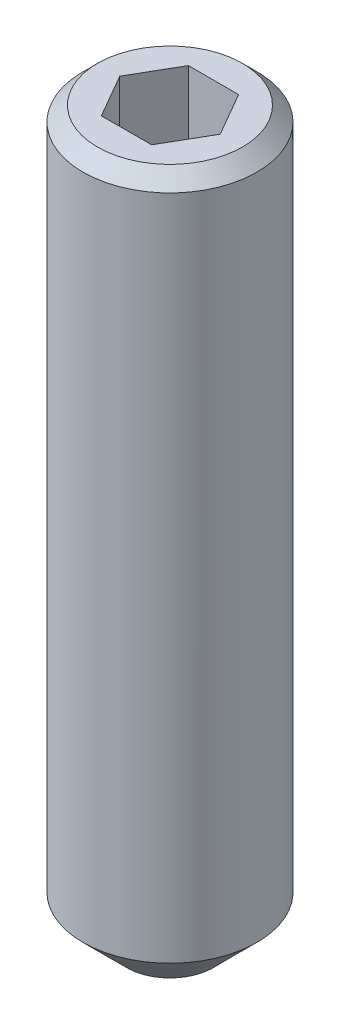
ISO-10303-21;
HEADER;
FILE_DESCRIPTION(('STEP AP214'),'2;1');
FILE_NAME('part.step','',(''),(''),'','','');
FILE_SCHEMA(('AUTOMOTIVE_DESIGN { 1 0 10303 214 1 1 1 1 }'));
ENDSEC;
DATA;
#1=APPLICATION_CONTEXT('core data for automotive mechanical design processes');
#2=APPLICATION_PROTOCOL_DEFINITION('international standard','automotive_design',2000,#1);
#3=PRODUCT_CONTEXT('',#1,'mechanical');
#4=PRODUCT('Part','Part','',(#3));
#5=PRODUCT_RELATED_PRODUCT_CATEGORY('part','',(#4));
#6=PRODUCT_DEFINITION_FORMATION('','',#4);
#7=PRODUCT_DEFINITION_CONTEXT('part definition',#1,'design');
#8=PRODUCT_DEFINITION('design','',#6,#7);
#9=PRODUCT_DEFINITION_SHAPE('','',#8);
#10=(LENGTH_UNIT() NAMED_UNIT(*) SI_UNIT(.MILLI.,.METRE.));
#11=(NAMED_UNIT(*) PLANE_ANGLE_UNIT() SI_UNIT($,.RADIAN.));
#12=(NAMED_UNIT(*) SI_UNIT($,.STERADIAN.) SOLID_ANGLE_UNIT());
#13=UNCERTAINTY_MEASURE_WITH_UNIT(LENGTH_MEASURE(1.E-05),#10,'distance_accuracy_value','');
#14=(GEOMETRIC_REPRESENTATION_CONTEXT(3) GLOBAL_UNCERTAINTY_ASSIGNED_CONTEXT((#13)) GLOBAL_UNIT_ASSIGNED_CONTEXT((#10,
#11,#12)) REPRESENTATION_CONTEXT('',''));
#15=CARTESIAN_POINT('',(0.,0.,0.));
#16=DIRECTION('',(0.,0.,1.));
#17=DIRECTION('',(1.,0.,0.));
#18=AXIS2_PLACEMENT_3D('',#15,#16,#17);
#19=CARTESIAN_POINT('',(0.,25.,0.));
#20=DIRECTION('',(0.,-1.,0.));
#21=DIRECTION('',(0.,0.,-1.));
#22=AXIS2_PLACEMENT_3D('',#19,#20,#21);
#23=CYLINDRICAL_SURFACE('',#22,3.);
#24=CARTESIAN_POINT('',(0.,24.5,0.));
#25=DIRECTION('',(0.,1.,0.));
#26=DIRECTION('',(0.,0.,1.));
#27=AXIS2_PLACEMENT_3D('',#24,#25,#26);
#28=CIRCLE('',#27,3.);
#29=CARTESIAN_POINT('',(0.,24.5,3.));
#30=VERTEX_POINT('',#29);
#31=EDGE_CURVE('E12',#30,#30,#28,.F.);
#32=ORIENTED_EDGE('',*,*,#31,.T.);
#33=EDGE_LOOP('',(#32));
#34=FACE_BOUND('',#33,.T.);
#35=CARTESIAN_POINT('',(0.,1.5,0.));
#36=DIRECTION('',(0.,1.,0.));
#37=DIRECTION('',(0.,0.,1.));
#38=AXIS2_PLACEMENT_3D('',#35,#36,#37);
#39=CIRCLE('',#38,3.);
#40=CARTESIAN_POINT('',(0.,1.5,3.));
#41=VERTEX_POINT('',#40);
#42=EDGE_CURVE('E127',#41,#41,#39,.F.);
#43=ORIENTED_EDGE('',*,*,#42,.F.);
#44=EDGE_LOOP('',(#43));
#45=FACE_BOUND('',#44,.T.);
#46=ADVANCED_FACE('F38',(#34,#45),#23,.T.);
#47=CARTESIAN_POINT('',(0.,25.,0.));
#48=DIRECTION('',(0.,1.,0.));
#49=DIRECTION('',(0.,0.,1.));
#50=AXIS2_PLACEMENT_3D('',#47,#48,#49);
#51=PLANE('',#50);
#52=CARTESIAN_POINT('',(0.,25.,0.));
#53=DIRECTION('',(0.,1.,0.));
#54=DIRECTION('',(0.,0.,1.));
#55=AXIS2_PLACEMENT_3D('',#52,#53,#54);
#56=CIRCLE('',#55,2.5);
#57=CARTESIAN_POINT('',(0.,25.,2.5));
#58=VERTEX_POINT('',#57);
#59=EDGE_CURVE('E46',#58,#58,#56,.T.);
#60=ORIENTED_EDGE('',*,*,#59,.T.);
#61=EDGE_LOOP('',(#60));
#62=FACE_BOUND('',#61,.T.);
#63=DIRECTION('',(-1.,0.,0.));
#64=VECTOR('',#63,1.);
#65=CARTESIAN_POINT('',(0.866025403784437,25.,1.5));
#66=LINE('',#65,#64);
#67=CARTESIAN_POINT('',(0.866025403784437,25.,1.5));
#68=VERTEX_POINT('',#67);
#69=CARTESIAN_POINT('',(-0.866025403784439,25.,1.5));
#70=VERTEX_POINT('',#69);
#71=EDGE_CURVE('E136',#68,#70,#66,.T.);
#72=ORIENTED_EDGE('',*,*,#71,.T.);
#73=DIRECTION('',(-0.5,0.,-0.866025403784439));
#74=VECTOR('',#73,1.);
#75=CARTESIAN_POINT('',(-0.866025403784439,25.,1.5));
#76=LINE('',#75,#74);
#77=CARTESIAN_POINT('',(-1.73205080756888,25.,0.));
#78=VERTEX_POINT('',#77);
#79=EDGE_CURVE('E53',#70,#78,#76,.T.);
#80=ORIENTED_EDGE('',*,*,#79,.T.);
#81=DIRECTION('',(0.5,0.,-0.866025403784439));
#82=VECTOR('',#81,1.);
#83=CARTESIAN_POINT('',(-1.73205080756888,25.,0.));
#84=LINE('',#83,#82);
#85=CARTESIAN_POINT('',(-0.866025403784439,25.,-1.5));
#86=VERTEX_POINT('',#85);
#87=EDGE_CURVE('E126',#78,#86,#84,.T.);
#88=ORIENTED_EDGE('',*,*,#87,.T.);
#89=DIRECTION('',(1.,0.,0.));
#90=VECTOR('',#89,1.);
#91=CARTESIAN_POINT('',(-0.866025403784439,25.,-1.5));
#92=LINE('',#91,#90);
#93=CARTESIAN_POINT('',(0.866025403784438,25.,-1.5));
#94=VERTEX_POINT('',#93);
#95=EDGE_CURVE('E130',#86,#94,#92,.T.);
#96=ORIENTED_EDGE('',*,*,#95,.T.);
#97=DIRECTION('',(0.5,0.,0.866025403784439));
#98=VECTOR('',#97,1.);
#99=CARTESIAN_POINT('',(0.866025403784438,25.,-1.5));
#100=LINE('',#99,#98);
#101=CARTESIAN_POINT('',(1.73205080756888,25.,0.));
#102=VERTEX_POINT('',#101);
#103=EDGE_CURVE('E133',#94,#102,#100,.T.);
#104=ORIENTED_EDGE('',*,*,#103,.T.);
#105=DIRECTION('',(-0.5,0.,0.866025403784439));
#106=VECTOR('',#105,1.);
#107=CARTESIAN_POINT('',(1.73205080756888,25.,0.));
#108=LINE('',#107,#106);
#109=EDGE_CURVE('E116',#102,#68,#108,.T.);
#110=ORIENTED_EDGE('',*,*,#109,.T.);
#111=EDGE_LOOP('',(#72,#80,#88,#96,#104,#110));
#112=FACE_BOUND('',#111,.T.);
#113=ADVANCED_FACE('F149',(#62,#112),#51,.T.);
#114=CARTESIAN_POINT('',(0.,25.,0.));
#115=DIRECTION('',(0.,-1.,0.));
#116=DIRECTION('',(0.,0.,-1.));
#117=AXIS2_PLACEMENT_3D('',#114,#115,#116);
#118=CONICAL_SURFACE('',#117,2.5,0.785398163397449);
#119=ORIENTED_EDGE('',*,*,#31,.F.);
#120=EDGE_LOOP('',(#119));
#121=FACE_BOUND('',#120,.T.);
#122=ORIENTED_EDGE('',*,*,#59,.F.);
#123=EDGE_LOOP('',(#122));
#124=FACE_BOUND('',#123,.T.);
#125=ADVANCED_FACE('F40',(#121,#124),#118,.T.);
#126=CARTESIAN_POINT('',(-0.866025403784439,21.5,1.5));
#127=DIRECTION('',(0.866025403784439,0.,-0.5));
#128=DIRECTION('',(-0.5,0.,-0.866025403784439));
#129=AXIS2_PLACEMENT_3D('',#126,#127,#128);
#130=PLANE('',#129);
#131=ORIENTED_EDGE('',*,*,#79,.F.);
#132=DIRECTION('',(0.,1.,0.));
#133=VECTOR('',#132,1.);
#134=CARTESIAN_POINT('',(-0.866025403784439,21.5,1.5));
#135=LINE('',#134,#133);
#136=CARTESIAN_POINT('',(-0.866025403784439,21.5,1.5));
#137=VERTEX_POINT('',#136);
#138=EDGE_CURVE('E121',#137,#70,#135,.T.);
#139=ORIENTED_EDGE('',*,*,#138,.F.);
#140=DIRECTION('',(-0.5,0.,-0.866025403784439));
#141=VECTOR('',#140,1.);
#142=CARTESIAN_POINT('',(-0.866025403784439,21.5,1.5));
#143=LINE('',#142,#141);
#144=CARTESIAN_POINT('',(-1.73205080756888,21.5,0.));
#145=VERTEX_POINT('',#144);
#146=EDGE_CURVE('E139',#137,#145,#143,.T.);
#147=ORIENTED_EDGE('',*,*,#146,.T.);
#148=DIRECTION('',(0.,1.,0.));
#149=VECTOR('',#148,1.);
#150=CARTESIAN_POINT('',(-1.73205080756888,21.5,0.));
#151=LINE('',#150,#149);
#152=EDGE_CURVE('E145',#145,#78,#151,.T.);
#153=ORIENTED_EDGE('',*,*,#152,.T.);
#154=EDGE_LOOP('',(#131,#139,#147,#153));
#155=FACE_BOUND('',#154,.T.);
#156=ADVANCED_FACE('F153',(#155),#130,.T.);
#157=CARTESIAN_POINT('',(-1.73205080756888,21.5,0.));
#158=DIRECTION('',(0.866025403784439,0.,0.5));
#159=DIRECTION('',(0.5,0.,-0.866025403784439));
#160=AXIS2_PLACEMENT_3D('',#157,#158,#159);
#161=PLANE('',#160);
#162=ORIENTED_EDGE('',*,*,#87,.F.);
#163=ORIENTED_EDGE('',*,*,#152,.F.);
#164=DIRECTION('',(0.5,0.,-0.866025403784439));
#165=VECTOR('',#164,1.);
#166=CARTESIAN_POINT('',(-1.73205080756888,21.5,0.));
#167=LINE('',#166,#165);
#168=CARTESIAN_POINT('',(-0.866025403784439,21.5,-1.5));
#169=VERTEX_POINT('',#168);
#170=EDGE_CURVE('E93',#145,#169,#167,.T.);
#171=ORIENTED_EDGE('',*,*,#170,.T.);
#172=DIRECTION('',(0.,1.,0.));
#173=VECTOR('',#172,1.);
#174=CARTESIAN_POINT('',(-0.866025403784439,21.5,-1.5));
#175=LINE('',#174,#173);
#176=EDGE_CURVE('E143',#169,#86,#175,.T.);
#177=ORIENTED_EDGE('',*,*,#176,.T.);
#178=EDGE_LOOP('',(#162,#163,#171,#177));
#179=FACE_BOUND('',#178,.T.);
#180=ADVANCED_FACE('F159',(#179),#161,.T.);
#181=CARTESIAN_POINT('',(-0.866025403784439,21.5,-1.5));
#182=DIRECTION('',(0.,0.,1.));
#183=DIRECTION('',(1.,0.,0.));
#184=AXIS2_PLACEMENT_3D('',#181,#182,#183);
#185=PLANE('',#184);
#186=ORIENTED_EDGE('',*,*,#95,.F.);
#187=ORIENTED_EDGE('',*,*,#176,.F.);
#188=DIRECTION('',(1.,0.,0.));
#189=VECTOR('',#188,1.);
#190=CARTESIAN_POINT('',(-0.866025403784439,21.5,-1.5));
#191=LINE('',#190,#189);
#192=CARTESIAN_POINT('',(0.866025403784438,21.5,-1.5));
#193=VERTEX_POINT('',#192);
#194=EDGE_CURVE('E112',#169,#193,#191,.T.);
#195=ORIENTED_EDGE('',*,*,#194,.T.);
#196=DIRECTION('',(0.,1.,0.));
#197=VECTOR('',#196,1.);
#198=CARTESIAN_POINT('',(0.866025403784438,21.5,-1.5));
#199=LINE('',#198,#197);
#200=EDGE_CURVE('E109',#193,#94,#199,.T.);
#201=ORIENTED_EDGE('',*,*,#200,.T.);
#202=EDGE_LOOP('',(#186,#187,#195,#201));
#203=FACE_BOUND('',#202,.T.);
#204=ADVANCED_FACE('F171',(#203),#185,.T.);
#205=CARTESIAN_POINT('',(0.866025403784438,21.5,-1.5));
#206=DIRECTION('',(-0.866025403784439,0.,0.5));
#207=DIRECTION('',(0.5,0.,0.866025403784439));
#208=AXIS2_PLACEMENT_3D('',#205,#206,#207);
#209=PLANE('',#208);
#210=ORIENTED_EDGE('',*,*,#103,.F.);
#211=ORIENTED_EDGE('',*,*,#200,.F.);
#212=DIRECTION('',(0.5,0.,0.866025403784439));
#213=VECTOR('',#212,1.);
#214=CARTESIAN_POINT('',(0.866025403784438,21.5,-1.5));
#215=LINE('',#214,#213);
#216=CARTESIAN_POINT('',(1.73205080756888,21.5,0.));
#217=VERTEX_POINT('',#216);
#218=EDGE_CURVE('E104',#193,#217,#215,.T.);
#219=ORIENTED_EDGE('',*,*,#218,.T.);
#220=DIRECTION('',(0.,1.,0.));
#221=VECTOR('',#220,1.);
#222=CARTESIAN_POINT('',(1.73205080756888,21.5,0.));
#223=LINE('',#222,#221);
#224=EDGE_CURVE('E108',#217,#102,#223,.T.);
#225=ORIENTED_EDGE('',*,*,#224,.T.);
#226=EDGE_LOOP('',(#210,#211,#219,#225));
#227=FACE_BOUND('',#226,.T.);
#228=ADVANCED_FACE('F107',(#227),#209,.T.);
#229=CARTESIAN_POINT('',(1.73205080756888,21.5,0.));
#230=DIRECTION('',(-0.866025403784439,0.,-0.5));
#231=DIRECTION('',(-0.5,0.,0.866025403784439));
#232=AXIS2_PLACEMENT_3D('',#229,#230,#231);
#233=PLANE('',#232);
#234=ORIENTED_EDGE('',*,*,#109,.F.);
#235=ORIENTED_EDGE('',*,*,#224,.F.);
#236=DIRECTION('',(-0.5,0.,0.866025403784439));
#237=VECTOR('',#236,1.);
#238=CARTESIAN_POINT('',(1.73205080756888,21.5,0.));
#239=LINE('',#238,#237);
#240=CARTESIAN_POINT('',(0.866025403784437,21.5,1.5));
#241=VERTEX_POINT('',#240);
#242=EDGE_CURVE('E111',#217,#241,#239,.T.);
#243=ORIENTED_EDGE('',*,*,#242,.T.);
#244=DIRECTION('',(0.,1.,0.));
#245=VECTOR('',#244,1.);
#246=CARTESIAN_POINT('',(0.866025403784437,21.5,1.5));
#247=LINE('',#246,#245);
#248=EDGE_CURVE('E84',#241,#68,#247,.T.);
#249=ORIENTED_EDGE('',*,*,#248,.T.);
#250=EDGE_LOOP('',(#234,#235,#243,#249));
#251=FACE_BOUND('',#250,.T.);
#252=ADVANCED_FACE('F114',(#251),#233,.T.);
#253=CARTESIAN_POINT('',(0.866025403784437,21.5,1.5));
#254=DIRECTION('',(0.,0.,-1.));
#255=DIRECTION('',(-1.,0.,0.));
#256=AXIS2_PLACEMENT_3D('',#253,#254,#255);
#257=PLANE('',#256);
#258=ORIENTED_EDGE('',*,*,#71,.F.);
#259=ORIENTED_EDGE('',*,*,#248,.F.);
#260=DIRECTION('',(-1.,0.,0.));
#261=VECTOR('',#260,1.);
#262=CARTESIAN_POINT('',(0.866025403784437,21.5,1.5));
#263=LINE('',#262,#261);
#264=EDGE_CURVE('E61',#241,#137,#263,.T.);
#265=ORIENTED_EDGE('',*,*,#264,.T.);
#266=ORIENTED_EDGE('',*,*,#138,.T.);
#267=EDGE_LOOP('',(#258,#259,#265,#266));
#268=FACE_BOUND('',#267,.T.);
#269=ADVANCED_FACE('F180',(#268),#257,.T.);
#270=CARTESIAN_POINT('',(-2.59807621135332,21.5,-1.5));
#271=DIRECTION('',(0.,-1.,0.));
#272=DIRECTION('',(0.,0.,-1.));
#273=AXIS2_PLACEMENT_3D('',#270,#271,#272);
#274=PLANE('',#273);
#275=ORIENTED_EDGE('',*,*,#146,.F.);
#276=ORIENTED_EDGE('',*,*,#264,.F.);
#277=ORIENTED_EDGE('',*,*,#242,.F.);
#278=ORIENTED_EDGE('',*,*,#218,.F.);
#279=ORIENTED_EDGE('',*,*,#194,.F.);
#280=ORIENTED_EDGE('',*,*,#170,.F.);
#281=EDGE_LOOP('',(#275,#276,#277,#278,#279,#280));
#282=FACE_BOUND('',#281,.T.);
#283=ADVANCED_FACE('F119',(#282),#274,.F.);
#284=CARTESIAN_POINT('',(0.,0.,0.));
#285=DIRECTION('',(0.,1.,0.));
#286=DIRECTION('',(0.,0.,-1.));
#287=AXIS2_PLACEMENT_3D('',#284,#285,#286);
#288=CONICAL_SURFACE('',#287,1.5,0.78539816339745);
#289=CARTESIAN_POINT('',(0.,0.,0.));
#290=DIRECTION('',(0.,-1.,0.));
#291=DIRECTION('',(0.,0.,-1.));
#292=AXIS2_PLACEMENT_3D('',#289,#290,#291);
#293=CIRCLE('',#292,1.5);
#294=CARTESIAN_POINT('',(0.,0.,-1.5));
#295=VERTEX_POINT('',#294);
#296=EDGE_CURVE('E197',#295,#295,#293,.T.);
#297=ORIENTED_EDGE('',*,*,#296,.F.);
#298=EDGE_LOOP('',(#297));
#299=FACE_BOUND('',#298,.T.);
#300=ORIENTED_EDGE('',*,*,#42,.T.);
#301=EDGE_LOOP('',(#300));
#302=FACE_BOUND('',#301,.T.);
#303=ADVANCED_FACE('F185',(#299,#302),#288,.T.);
#304=CARTESIAN_POINT('',(0.,0.866025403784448,0.));
#305=DIRECTION('',(0.,-1.,0.));
#306=DIRECTION('',(0.,0.,-1.));
#307=AXIS2_PLACEMENT_3D('',#304,#305,#306);
#308=CONICAL_SURFACE('',#307,0.,1.04719755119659);
#309=ORIENTED_EDGE('',*,*,#296,.T.);
#310=EDGE_LOOP('',(#309));
#311=FACE_BOUND('',#310,.T.);
#312=CARTESIAN_POINT('',(0.,0.866025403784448,0.));
#313=VERTEX_POINT('',#312);
#314=VERTEX_LOOP('',#313);
#315=FACE_BOUND('',#314,.T.);
#316=ADVANCED_FACE('F186',(#311,#315),#308,.F.);
#317=CLOSED_SHELL('',(#46,#113,#125,#156,#180,#204,#228,#252,#269,#283,#303,#316));
#318=MANIFOLD_SOLID_BREP('B2',#317);
#319=ADVANCED_BREP_SHAPE_REPRESENTATION('',(#18,#318),#14);
#320=SHAPE_DEFINITION_REPRESENTATION(#9,#319);
ENDSEC;
END-ISO-10303-21;
